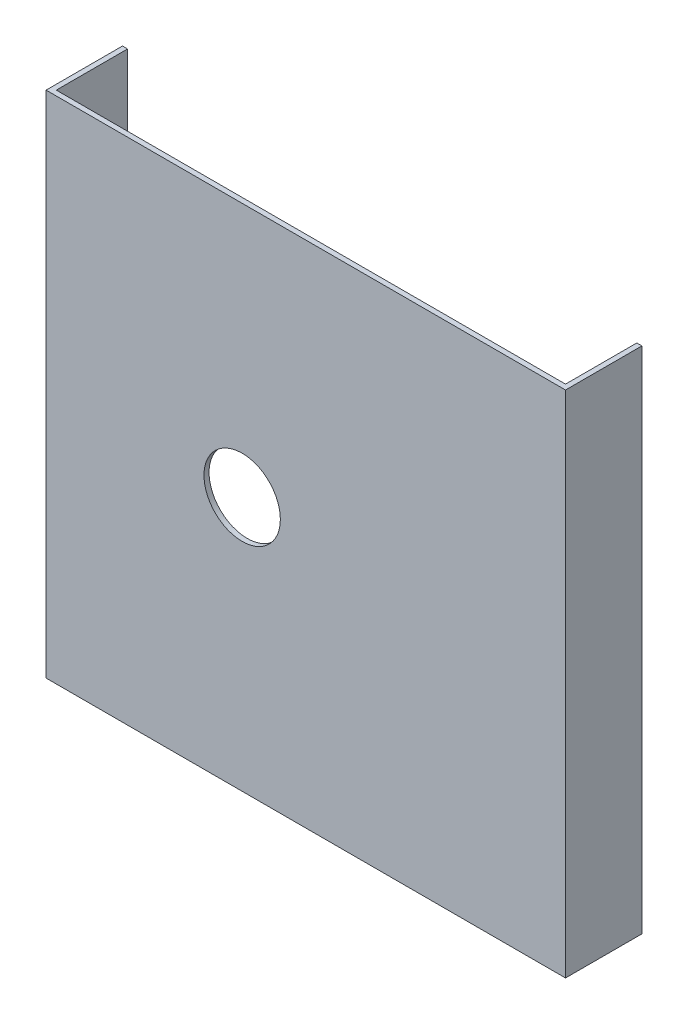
ISO-10303-21;
HEADER;
FILE_DESCRIPTION(('STEP AP214'),'2;1');
FILE_NAME('part.step','',(''),(''),'','','');
FILE_SCHEMA(('AUTOMOTIVE_DESIGN { 1 0 10303 214 1 1 1 1 }'));
ENDSEC;
DATA;
#1=APPLICATION_CONTEXT('core data for automotive mechanical design processes');
#2=APPLICATION_PROTOCOL_DEFINITION('international standard','automotive_design',2000,#1);
#3=PRODUCT_CONTEXT('',#1,'mechanical');
#4=PRODUCT('Part','Part','',(#3));
#5=PRODUCT_RELATED_PRODUCT_CATEGORY('part','',(#4));
#6=PRODUCT_DEFINITION_FORMATION('','',#4);
#7=PRODUCT_DEFINITION_CONTEXT('part definition',#1,'design');
#8=PRODUCT_DEFINITION('design','',#6,#7);
#9=PRODUCT_DEFINITION_SHAPE('','',#8);
#10=(LENGTH_UNIT() NAMED_UNIT(*) SI_UNIT(.MILLI.,.METRE.));
#11=(NAMED_UNIT(*) PLANE_ANGLE_UNIT() SI_UNIT($,.RADIAN.));
#12=(NAMED_UNIT(*) SI_UNIT($,.STERADIAN.) SOLID_ANGLE_UNIT());
#13=UNCERTAINTY_MEASURE_WITH_UNIT(LENGTH_MEASURE(1.E-05),#10,'distance_accuracy_value','');
#14=(GEOMETRIC_REPRESENTATION_CONTEXT(3) GLOBAL_UNCERTAINTY_ASSIGNED_CONTEXT((#13)) GLOBAL_UNIT_ASSIGNED_CONTEXT((#10,
#11,#12)) REPRESENTATION_CONTEXT('',''));
#15=CARTESIAN_POINT('',(0.,0.,0.));
#16=DIRECTION('',(0.,0.,1.));
#17=DIRECTION('',(1.,0.,0.));
#18=AXIS2_PLACEMENT_3D('',#15,#16,#17);
#19=CARTESIAN_POINT('',(0.,0.,2.));
#20=DIRECTION('',(0.,0.,-1.));
#21=DIRECTION('',(-1.,0.,0.));
#22=AXIS2_PLACEMENT_3D('',#19,#20,#21);
#23=PLANE('',#22);
#24=DIRECTION('',(1.,0.,0.));
#25=VECTOR('',#24,1.);
#26=CARTESIAN_POINT('',(-100.,-100.,2.));
#27=LINE('',#26,#25);
#28=CARTESIAN_POINT('',(-102.,-100.,2.00000000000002));
#29=VERTEX_POINT('',#28);
#30=CARTESIAN_POINT('',(102.,-100.,2.00000000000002));
#31=VERTEX_POINT('',#30);
#32=EDGE_CURVE('E11',#29,#31,#27,.T.);
#33=ORIENTED_EDGE('',*,*,#32,.T.);
#34=DIRECTION('',(0.,1.,0.));
#35=VECTOR('',#34,1.);
#36=CARTESIAN_POINT('',(102.,100.,2.));
#37=LINE('',#36,#35);
#38=CARTESIAN_POINT('',(102.,100.,2.));
#39=VERTEX_POINT('',#38);
#40=EDGE_CURVE('E108',#31,#39,#37,.T.);
#41=ORIENTED_EDGE('',*,*,#40,.T.);
#42=DIRECTION('',(-1.,0.,0.));
#43=VECTOR('',#42,1.);
#44=CARTESIAN_POINT('',(-100.,100.,2.));
#45=LINE('',#44,#43);
#46=CARTESIAN_POINT('',(-102.,100.,2.));
#47=VERTEX_POINT('',#46);
#48=EDGE_CURVE('E49',#39,#47,#45,.T.);
#49=ORIENTED_EDGE('',*,*,#48,.T.);
#50=DIRECTION('',(0.,1.,0.));
#51=VECTOR('',#50,1.);
#52=CARTESIAN_POINT('',(-102.,100.,2.));
#53=LINE('',#52,#51);
#54=EDGE_CURVE('E111',#29,#47,#53,.T.);
#55=ORIENTED_EDGE('',*,*,#54,.F.);
#56=EDGE_LOOP('',(#33,#41,#49,#55));
#57=FACE_BOUND('',#56,.T.);
#58=CARTESIAN_POINT('',(-25.,0.,2.));
#59=DIRECTION('',(0.,0.,1.));
#60=DIRECTION('',(1.,0.,0.));
#61=AXIS2_PLACEMENT_3D('',#58,#59,#60);
#62=CIRCLE('',#61,15.);
#63=CARTESIAN_POINT('',(-10.,0.,2.));
#64=VERTEX_POINT('',#63);
#65=EDGE_CURVE('E163',#64,#64,#62,.T.);
#66=ORIENTED_EDGE('',*,*,#65,.F.);
#67=EDGE_LOOP('',(#66));
#68=FACE_BOUND('',#67,.T.);
#69=ADVANCED_FACE('F40',(#57,#68),#23,.F.);
#70=CARTESIAN_POINT('',(0.,0.,0.));
#71=DIRECTION('',(0.,0.,-1.));
#72=DIRECTION('',(-1.,0.,0.));
#73=AXIS2_PLACEMENT_3D('',#70,#71,#72);
#74=PLANE('',#73);
#75=DIRECTION('',(0.,1.,0.));
#76=VECTOR('',#75,1.);
#77=CARTESIAN_POINT('',(100.,-100.,0.));
#78=LINE('',#77,#76);
#79=CARTESIAN_POINT('',(100.,-100.,0.));
#80=VERTEX_POINT('',#79);
#81=CARTESIAN_POINT('',(100.,100.,0.));
#82=VERTEX_POINT('',#81);
#83=EDGE_CURVE('E166',#80,#82,#78,.T.);
#84=ORIENTED_EDGE('',*,*,#83,.F.);
#85=DIRECTION('',(1.,0.,0.));
#86=VECTOR('',#85,1.);
#87=CARTESIAN_POINT('',(-100.,-100.,0.));
#88=LINE('',#87,#86);
#89=CARTESIAN_POINT('',(-100.,-100.,0.));
#90=VERTEX_POINT('',#89);
#91=EDGE_CURVE('E44',#90,#80,#88,.T.);
#92=ORIENTED_EDGE('',*,*,#91,.F.);
#93=DIRECTION('',(0.,-1.,0.));
#94=VECTOR('',#93,1.);
#95=CARTESIAN_POINT('',(-100.,-100.,0.));
#96=LINE('',#95,#94);
#97=CARTESIAN_POINT('',(-100.,100.,0.));
#98=VERTEX_POINT('',#97);
#99=EDGE_CURVE('E172',#98,#90,#96,.T.);
#100=ORIENTED_EDGE('',*,*,#99,.F.);
#101=DIRECTION('',(-1.,0.,0.));
#102=VECTOR('',#101,1.);
#103=CARTESIAN_POINT('',(-100.,100.,0.));
#104=LINE('',#103,#102);
#105=EDGE_CURVE('E64',#82,#98,#104,.T.);
#106=ORIENTED_EDGE('',*,*,#105,.F.);
#107=EDGE_LOOP('',(#84,#92,#100,#106));
#108=FACE_BOUND('',#107,.T.);
#109=CARTESIAN_POINT('',(-25.,0.,0.));
#110=DIRECTION('',(0.,0.,1.));
#111=DIRECTION('',(1.,0.,0.));
#112=AXIS2_PLACEMENT_3D('',#109,#110,#111);
#113=CIRCLE('',#112,15.);
#114=CARTESIAN_POINT('',(-10.,0.,0.));
#115=VERTEX_POINT('',#114);
#116=EDGE_CURVE('E162',#115,#115,#113,.T.);
#117=ORIENTED_EDGE('',*,*,#116,.T.);
#118=EDGE_LOOP('',(#117));
#119=FACE_BOUND('',#118,.T.);
#120=ADVANCED_FACE('F200',(#108,#119),#74,.T.);
#121=CARTESIAN_POINT('',(-100.,100.,2.));
#122=DIRECTION('',(0.,-1.,0.));
#123=DIRECTION('',(0.,0.,-1.));
#124=AXIS2_PLACEMENT_3D('',#121,#122,#123);
#125=PLANE('',#124);
#126=ORIENTED_EDGE('',*,*,#105,.T.);
#127=DIRECTION('',(0.,0.,-1.));
#128=VECTOR('',#127,1.);
#129=CARTESIAN_POINT('',(-100.,100.,2.));
#130=LINE('',#129,#128);
#131=CARTESIAN_POINT('',(-100.,100.,-28.));
#132=VERTEX_POINT('',#131);
#133=EDGE_CURVE('E143',#98,#132,#130,.T.);
#134=ORIENTED_EDGE('',*,*,#133,.T.);
#135=DIRECTION('',(1.,0.,0.));
#136=VECTOR('',#135,1.);
#137=CARTESIAN_POINT('',(-102.,100.,-28.));
#138=LINE('',#137,#136);
#139=CARTESIAN_POINT('',(-102.,100.,-28.));
#140=VERTEX_POINT('',#139);
#141=EDGE_CURVE('E159',#140,#132,#138,.T.);
#142=ORIENTED_EDGE('',*,*,#141,.F.);
#143=DIRECTION('',(0.,0.,-1.));
#144=VECTOR('',#143,1.);
#145=CARTESIAN_POINT('',(-102.,100.,2.));
#146=LINE('',#145,#144);
#147=EDGE_CURVE('E145',#47,#140,#146,.T.);
#148=ORIENTED_EDGE('',*,*,#147,.F.);
#149=ORIENTED_EDGE('',*,*,#48,.F.);
#150=DIRECTION('',(0.,0.,-1.));
#151=VECTOR('',#150,1.);
#152=CARTESIAN_POINT('',(102.,100.,2.));
#153=LINE('',#152,#151);
#154=CARTESIAN_POINT('',(102.,100.,-28.));
#155=VERTEX_POINT('',#154);
#156=EDGE_CURVE('E122',#39,#155,#153,.T.);
#157=ORIENTED_EDGE('',*,*,#156,.T.);
#158=DIRECTION('',(-1.,0.,0.));
#159=VECTOR('',#158,1.);
#160=CARTESIAN_POINT('',(102.,100.,-28.));
#161=LINE('',#160,#159);
#162=CARTESIAN_POINT('',(100.,100.,-28.));
#163=VERTEX_POINT('',#162);
#164=EDGE_CURVE('E132',#155,#163,#161,.T.);
#165=ORIENTED_EDGE('',*,*,#164,.T.);
#166=DIRECTION('',(0.,0.,-1.));
#167=VECTOR('',#166,1.);
#168=CARTESIAN_POINT('',(100.,100.,2.));
#169=LINE('',#168,#167);
#170=EDGE_CURVE('E123',#82,#163,#169,.T.);
#171=ORIENTED_EDGE('',*,*,#170,.F.);
#172=EDGE_LOOP('',(#126,#134,#142,#148,#149,#157,#165,#171));
#173=FACE_BOUND('',#172,.T.);
#174=ADVANCED_FACE('F42',(#173),#125,.F.);
#175=CARTESIAN_POINT('',(-100.,-100.,2.));
#176=DIRECTION('',(0.,1.,0.));
#177=DIRECTION('',(0.,0.,1.));
#178=AXIS2_PLACEMENT_3D('',#175,#176,#177);
#179=PLANE('',#178);
#180=ORIENTED_EDGE('',*,*,#91,.T.);
#181=DIRECTION('',(0.,0.,1.));
#182=VECTOR('',#181,1.);
#183=CARTESIAN_POINT('',(100.,-100.,2.00000000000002));
#184=LINE('',#183,#182);
#185=CARTESIAN_POINT('',(100.,-100.,-28.));
#186=VERTEX_POINT('',#185);
#187=EDGE_CURVE('E133',#186,#80,#184,.T.);
#188=ORIENTED_EDGE('',*,*,#187,.F.);
#189=DIRECTION('',(-1.,0.,0.));
#190=VECTOR('',#189,1.);
#191=CARTESIAN_POINT('',(102.,-100.,-28.));
#192=LINE('',#191,#190);
#193=CARTESIAN_POINT('',(102.,-100.,-28.));
#194=VERTEX_POINT('',#193);
#195=EDGE_CURVE('E126',#194,#186,#192,.T.);
#196=ORIENTED_EDGE('',*,*,#195,.F.);
#197=DIRECTION('',(0.,0.,1.));
#198=VECTOR('',#197,1.);
#199=CARTESIAN_POINT('',(102.,-100.,2.00000000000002));
#200=LINE('',#199,#198);
#201=EDGE_CURVE('E119',#194,#31,#200,.T.);
#202=ORIENTED_EDGE('',*,*,#201,.T.);
#203=ORIENTED_EDGE('',*,*,#32,.F.);
#204=DIRECTION('',(0.,0.,1.));
#205=VECTOR('',#204,1.);
#206=CARTESIAN_POINT('',(-102.,-100.,2.00000000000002));
#207=LINE('',#206,#205);
#208=CARTESIAN_POINT('',(-102.,-100.,-28.));
#209=VERTEX_POINT('',#208);
#210=EDGE_CURVE('E150',#209,#29,#207,.T.);
#211=ORIENTED_EDGE('',*,*,#210,.F.);
#212=DIRECTION('',(1.,0.,0.));
#213=VECTOR('',#212,1.);
#214=CARTESIAN_POINT('',(-102.,-100.,-28.));
#215=LINE('',#214,#213);
#216=CARTESIAN_POINT('',(-100.,-100.,-28.));
#217=VERTEX_POINT('',#216);
#218=EDGE_CURVE('E152',#209,#217,#215,.T.);
#219=ORIENTED_EDGE('',*,*,#218,.T.);
#220=DIRECTION('',(0.,0.,1.));
#221=VECTOR('',#220,1.);
#222=CARTESIAN_POINT('',(-100.,-100.,2.00000000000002));
#223=LINE('',#222,#221);
#224=EDGE_CURVE('E146',#217,#90,#223,.T.);
#225=ORIENTED_EDGE('',*,*,#224,.T.);
#226=EDGE_LOOP('',(#180,#188,#196,#202,#203,#211,#219,#225));
#227=FACE_BOUND('',#226,.T.);
#228=ADVANCED_FACE('F125',(#227),#179,.F.);
#229=CARTESIAN_POINT('',(-25.,0.,2.));
#230=DIRECTION('',(0.,0.,-1.));
#231=DIRECTION('',(-1.,0.,0.));
#232=AXIS2_PLACEMENT_3D('',#229,#230,#231);
#233=CYLINDRICAL_SURFACE('',#232,15.);
#234=ORIENTED_EDGE('',*,*,#65,.T.);
#235=EDGE_LOOP('',(#234));
#236=FACE_BOUND('',#235,.T.);
#237=ORIENTED_EDGE('',*,*,#116,.F.);
#238=EDGE_LOOP('',(#237));
#239=FACE_BOUND('',#238,.T.);
#240=ADVANCED_FACE('F196',(#236,#239),#233,.F.);
#241=CARTESIAN_POINT('',(-102.,100.,-28.));
#242=DIRECTION('',(0.,0.,1.));
#243=DIRECTION('',(0.,-1.,0.));
#244=AXIS2_PLACEMENT_3D('',#241,#242,#243);
#245=PLANE('',#244);
#246=DIRECTION('',(0.,-1.,0.));
#247=VECTOR('',#246,1.);
#248=CARTESIAN_POINT('',(-100.,100.,-28.));
#249=LINE('',#248,#247);
#250=EDGE_CURVE('E154',#132,#217,#249,.T.);
#251=ORIENTED_EDGE('',*,*,#250,.T.);
#252=ORIENTED_EDGE('',*,*,#218,.F.);
#253=DIRECTION('',(0.,-1.,0.));
#254=VECTOR('',#253,1.);
#255=CARTESIAN_POINT('',(-102.,100.,-28.));
#256=LINE('',#255,#254);
#257=EDGE_CURVE('E148',#140,#209,#256,.T.);
#258=ORIENTED_EDGE('',*,*,#257,.F.);
#259=ORIENTED_EDGE('',*,*,#141,.T.);
#260=EDGE_LOOP('',(#251,#252,#258,#259));
#261=FACE_BOUND('',#260,.T.);
#262=ADVANCED_FACE('F183',(#261),#245,.F.);
#263=CARTESIAN_POINT('',(-102.,0.,0.));
#264=DIRECTION('',(1.,0.,0.));
#265=DIRECTION('',(0.,0.,-1.));
#266=AXIS2_PLACEMENT_3D('',#263,#264,#265);
#267=PLANE('',#266);
#268=ORIENTED_EDGE('',*,*,#54,.T.);
#269=ORIENTED_EDGE('',*,*,#147,.T.);
#270=ORIENTED_EDGE('',*,*,#257,.T.);
#271=ORIENTED_EDGE('',*,*,#210,.T.);
#272=EDGE_LOOP('',(#268,#269,#270,#271));
#273=FACE_BOUND('',#272,.T.);
#274=ADVANCED_FACE('F187',(#273),#267,.F.);
#275=CARTESIAN_POINT('',(-100.,0.,0.));
#276=DIRECTION('',(1.,0.,0.));
#277=DIRECTION('',(0.,0.,-1.));
#278=AXIS2_PLACEMENT_3D('',#275,#276,#277);
#279=PLANE('',#278);
#280=ORIENTED_EDGE('',*,*,#133,.F.);
#281=ORIENTED_EDGE('',*,*,#99,.T.);
#282=ORIENTED_EDGE('',*,*,#224,.F.);
#283=ORIENTED_EDGE('',*,*,#250,.F.);
#284=EDGE_LOOP('',(#280,#281,#282,#283));
#285=FACE_BOUND('',#284,.T.);
#286=ADVANCED_FACE('F177',(#285),#279,.T.);
#287=CARTESIAN_POINT('',(102.,100.,-28.));
#288=DIRECTION('',(0.,0.,-1.));
#289=DIRECTION('',(0.,1.,0.));
#290=AXIS2_PLACEMENT_3D('',#287,#288,#289);
#291=PLANE('',#290);
#292=DIRECTION('',(0.,-1.,0.));
#293=VECTOR('',#292,1.);
#294=CARTESIAN_POINT('',(100.,100.,-28.));
#295=LINE('',#294,#293);
#296=EDGE_CURVE('E136',#163,#186,#295,.T.);
#297=ORIENTED_EDGE('',*,*,#296,.F.);
#298=ORIENTED_EDGE('',*,*,#164,.F.);
#299=DIRECTION('',(0.,-1.,0.));
#300=VECTOR('',#299,1.);
#301=CARTESIAN_POINT('',(102.,100.,-28.));
#302=LINE('',#301,#300);
#303=EDGE_CURVE('E127',#155,#194,#302,.T.);
#304=ORIENTED_EDGE('',*,*,#303,.T.);
#305=ORIENTED_EDGE('',*,*,#195,.T.);
#306=EDGE_LOOP('',(#297,#298,#304,#305));
#307=FACE_BOUND('',#306,.T.);
#308=ADVANCED_FACE('F194',(#307),#291,.T.);
#309=CARTESIAN_POINT('',(102.,0.,0.));
#310=DIRECTION('',(-1.,0.,0.));
#311=DIRECTION('',(0.,0.,-1.));
#312=AXIS2_PLACEMENT_3D('',#309,#310,#311);
#313=PLANE('',#312);
#314=ORIENTED_EDGE('',*,*,#40,.F.);
#315=ORIENTED_EDGE('',*,*,#201,.F.);
#316=ORIENTED_EDGE('',*,*,#303,.F.);
#317=ORIENTED_EDGE('',*,*,#156,.F.);
#318=EDGE_LOOP('',(#314,#315,#316,#317));
#319=FACE_BOUND('',#318,.T.);
#320=ADVANCED_FACE('F117',(#319),#313,.F.);
#321=CARTESIAN_POINT('',(100.,0.,0.));
#322=DIRECTION('',(-1.,0.,0.));
#323=DIRECTION('',(0.,0.,-1.));
#324=AXIS2_PLACEMENT_3D('',#321,#322,#323);
#325=PLANE('',#324);
#326=ORIENTED_EDGE('',*,*,#187,.T.);
#327=ORIENTED_EDGE('',*,*,#83,.T.);
#328=ORIENTED_EDGE('',*,*,#170,.T.);
#329=ORIENTED_EDGE('',*,*,#296,.T.);
#330=EDGE_LOOP('',(#326,#327,#328,#329));
#331=FACE_BOUND('',#330,.T.);
#332=ADVANCED_FACE('F288',(#331),#325,.T.);
#333=CLOSED_SHELL('',(#69,#120,#174,#228,#240,#262,#274,#286,#308,#320,#332));
#334=MANIFOLD_SOLID_BREP('B2',#333);
#335=ADVANCED_BREP_SHAPE_REPRESENTATION('',(#18,#334),#14);
#336=SHAPE_DEFINITION_REPRESENTATION(#9,#335);
ENDSEC;
END-ISO-10303-21;
